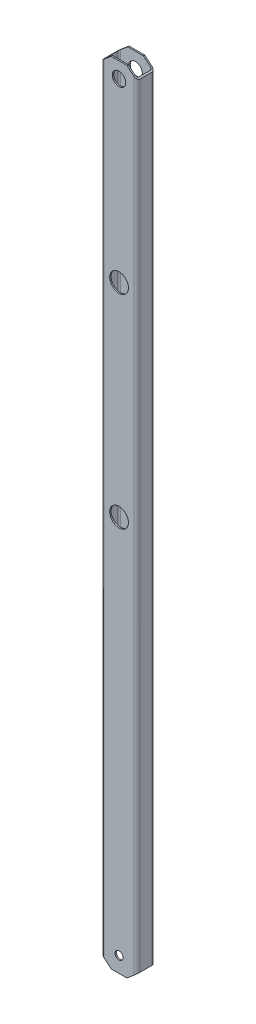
ISO-10303-21;
HEADER;
FILE_DESCRIPTION(('STEP AP214'),'2;1');
FILE_NAME('part.step','',(''),(''),'','','');
FILE_SCHEMA(('AUTOMOTIVE_DESIGN { 1 0 10303 214 1 1 1 1 }'));
ENDSEC;
DATA;
#1=APPLICATION_CONTEXT('core data for automotive mechanical design processes');
#2=APPLICATION_PROTOCOL_DEFINITION('international standard','automotive_design',2000,#1);
#3=PRODUCT_CONTEXT('',#1,'mechanical');
#4=PRODUCT('Part','Part','',(#3));
#5=PRODUCT_RELATED_PRODUCT_CATEGORY('part','',(#4));
#6=PRODUCT_DEFINITION_FORMATION('','',#4);
#7=PRODUCT_DEFINITION_CONTEXT('part definition',#1,'design');
#8=PRODUCT_DEFINITION('design','',#6,#7);
#9=PRODUCT_DEFINITION_SHAPE('','',#8);
#10=(LENGTH_UNIT() NAMED_UNIT(*) SI_UNIT(.MILLI.,.METRE.));
#11=(NAMED_UNIT(*) PLANE_ANGLE_UNIT() SI_UNIT($,.RADIAN.));
#12=(NAMED_UNIT(*) SI_UNIT($,.STERADIAN.) SOLID_ANGLE_UNIT());
#13=UNCERTAINTY_MEASURE_WITH_UNIT(LENGTH_MEASURE(1.E-05),#10,'distance_accuracy_value','');
#14=(GEOMETRIC_REPRESENTATION_CONTEXT(3) GLOBAL_UNCERTAINTY_ASSIGNED_CONTEXT((#13)) GLOBAL_UNIT_ASSIGNED_CONTEXT((#10,
#11,#12)) REPRESENTATION_CONTEXT('',''));
#15=CARTESIAN_POINT('',(0.,0.,0.));
#16=DIRECTION('',(0.,0.,1.));
#17=DIRECTION('',(1.,0.,0.));
#18=AXIS2_PLACEMENT_3D('',#15,#16,#17);
#19=CARTESIAN_POINT('',(33.6,-885.,-13.6000000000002));
#20=DIRECTION('',(0.,-1.,0.));
#21=DIRECTION('',(0.,0.,-1.));
#22=AXIS2_PLACEMENT_3D('',#19,#20,#21);
#23=PLANE('',#22);
#24=DIRECTION('',(0.,0.,-1.));
#25=VECTOR('',#24,1.);
#26=CARTESIAN_POINT('',(17.4999999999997,-885.,-13.6000000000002));
#27=LINE('',#26,#25);
#28=CARTESIAN_POINT('',(17.4999999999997,-885.,20.0000000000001));
#29=VERTEX_POINT('',#28);
#30=CARTESIAN_POINT('',(17.4999999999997,-885.,16.9999999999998));
#31=VERTEX_POINT('',#30);
#32=EDGE_CURVE('E12',#29,#31,#27,.T.);
#33=ORIENTED_EDGE('',*,*,#32,.F.);
#34=DIRECTION('',(-1.,0.,0.));
#35=VECTOR('',#34,1.);
#36=CARTESIAN_POINT('',(-33.6,-885.,19.9999999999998));
#37=LINE('',#36,#35);
#38=CARTESIAN_POINT('',(-17.5000000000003,-885.,20.0000000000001));
#39=VERTEX_POINT('',#38);
#40=EDGE_CURVE('E235',#29,#39,#37,.T.);
#41=ORIENTED_EDGE('',*,*,#40,.T.);
#42=DIRECTION('',(0.,0.,1.));
#43=VECTOR('',#42,1.);
#44=CARTESIAN_POINT('',(-17.5000000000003,-885.,-13.6000000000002));
#45=LINE('',#44,#43);
#46=CARTESIAN_POINT('',(-17.5000000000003,-885.,16.9999999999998));
#47=VERTEX_POINT('',#46);
#48=EDGE_CURVE('E71',#47,#39,#45,.T.);
#49=ORIENTED_EDGE('',*,*,#48,.F.);
#50=DIRECTION('',(-1.,0.,0.));
#51=VECTOR('',#50,1.);
#52=CARTESIAN_POINT('',(-33.6,-885.,16.9999999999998));
#53=LINE('',#52,#51);
#54=EDGE_CURVE('E244',#31,#47,#53,.T.);
#55=ORIENTED_EDGE('',*,*,#54,.F.);
#56=EDGE_LOOP('',(#33,#41,#49,#55));
#57=FACE_BOUND('',#56,.T.);
#58=ADVANCED_FACE('F63',(#57),#23,.T.);
#59=CARTESIAN_POINT('',(33.6,885.,-13.5999999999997));
#60=DIRECTION('',(0.,-1.,0.));
#61=DIRECTION('',(0.,0.,-1.));
#62=AXIS2_PLACEMENT_3D('',#59,#60,#61);
#63=PLANE('',#62);
#64=DIRECTION('',(-1.,0.,0.));
#65=VECTOR('',#64,1.);
#66=CARTESIAN_POINT('',(-33.6,885.,20.0000000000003));
#67=LINE('',#66,#65);
#68=CARTESIAN_POINT('',(17.5,885.,20.0000000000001));
#69=VERTEX_POINT('',#68);
#70=CARTESIAN_POINT('',(-17.5,885.,20.0000000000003));
#71=VERTEX_POINT('',#70);
#72=EDGE_CURVE('E260',#69,#71,#67,.T.);
#73=ORIENTED_EDGE('',*,*,#72,.F.);
#74=DIRECTION('',(0.,0.,-1.));
#75=VECTOR('',#74,1.);
#76=CARTESIAN_POINT('',(17.5,885.,-13.5999999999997));
#77=LINE('',#76,#75);
#78=CARTESIAN_POINT('',(17.5,885.,17.0000000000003));
#79=VERTEX_POINT('',#78);
#80=EDGE_CURVE('E228',#69,#79,#77,.T.);
#81=ORIENTED_EDGE('',*,*,#80,.T.);
#82=DIRECTION('',(-1.,0.,0.));
#83=VECTOR('',#82,1.);
#84=CARTESIAN_POINT('',(-33.6,885.,17.0000000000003));
#85=LINE('',#84,#83);
#86=CARTESIAN_POINT('',(-17.5,885.,17.0000000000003));
#87=VERTEX_POINT('',#86);
#88=EDGE_CURVE('E256',#79,#87,#85,.T.);
#89=ORIENTED_EDGE('',*,*,#88,.T.);
#90=DIRECTION('',(0.,0.,1.));
#91=VECTOR('',#90,1.);
#92=CARTESIAN_POINT('',(-17.5,885.,-13.5999999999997));
#93=LINE('',#92,#91);
#94=EDGE_CURVE('E288',#87,#71,#93,.T.);
#95=ORIENTED_EDGE('',*,*,#94,.T.);
#96=EDGE_LOOP('',(#73,#81,#89,#95));
#97=FACE_BOUND('',#96,.T.);
#98=ADVANCED_FACE('F317',(#97),#63,.F.);
#99=CARTESIAN_POINT('',(33.6,-885.,-13.6000000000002));
#100=DIRECTION('',(0.,1.,0.));
#101=DIRECTION('',(0.,0.,1.));
#102=AXIS2_PLACEMENT_3D('',#99,#100,#101);
#103=CYLINDRICAL_SURFACE('',#102,6.40000000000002);
#104=DIRECTION('',(0.,1.,0.));
#105=VECTOR('',#104,1.);
#106=CARTESIAN_POINT('',(33.6,-885.,-20.0000000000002));
#107=LINE('',#106,#105);
#108=CARTESIAN_POINT('',(33.6,-871.490495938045,-20.0000000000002));
#109=VERTEX_POINT('',#108);
#110=CARTESIAN_POINT('',(33.5999999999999,871.490495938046,-19.9999999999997));
#111=VERTEX_POINT('',#110);
#112=EDGE_CURVE('E266',#109,#111,#107,.T.);
#113=ORIENTED_EDGE('',*,*,#112,.T.);
#114=CARTESIAN_POINT('',(33.6,871.490495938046,-13.5999999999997));
#115=DIRECTION('',(-0.642787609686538,-0.766044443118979,0.));
#116=DIRECTION('',(-0.766044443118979,0.642787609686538,0.));
#117=AXIS2_PLACEMENT_3D('',#114,#115,#116);
#118=ELLIPSE('',#117,8.35460665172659,6.40000000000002);
#119=CARTESIAN_POINT('',(40.,866.120258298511,-13.6000000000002));
#120=VERTEX_POINT('',#119);
#121=EDGE_CURVE('E363',#111,#120,#118,.T.);
#122=ORIENTED_EDGE('',*,*,#121,.T.);
#123=DIRECTION('',(0.,1.,0.));
#124=VECTOR('',#123,1.);
#125=CARTESIAN_POINT('',(40.,-885.,-13.6000000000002));
#126=LINE('',#125,#124);
#127=CARTESIAN_POINT('',(39.9999999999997,-866.120258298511,-13.6000000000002));
#128=VERTEX_POINT('',#127);
#129=EDGE_CURVE('E285',#128,#120,#126,.T.);
#130=ORIENTED_EDGE('',*,*,#129,.F.);
#131=CARTESIAN_POINT('',(33.6,-871.490495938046,-13.6000000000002));
#132=DIRECTION('',(-0.642787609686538,0.766044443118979,0.));
#133=DIRECTION('',(0.766044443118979,0.642787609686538,0.));
#134=AXIS2_PLACEMENT_3D('',#131,#132,#133);
#135=ELLIPSE('',#134,8.35460665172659,6.40000000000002);
#136=EDGE_CURVE('E392',#128,#109,#135,.T.);
#137=ORIENTED_EDGE('',*,*,#136,.T.);
#138=EDGE_LOOP('',(#113,#122,#130,#137));
#139=FACE_BOUND('',#138,.T.);
#140=ADVANCED_FACE('F566',(#139),#103,.T.);
#141=CARTESIAN_POINT('',(40.,-885.,-13.6000000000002));
#142=DIRECTION('',(-1.,0.,0.));
#143=DIRECTION('',(0.,0.,1.));
#144=AXIS2_PLACEMENT_3D('',#141,#142,#143);
#145=PLANE('',#144);
#146=ORIENTED_EDGE('',*,*,#129,.T.);
#147=DIRECTION('',(0.,0.,1.));
#148=VECTOR('',#147,1.);
#149=CARTESIAN_POINT('',(40.,866.120258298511,-79.3969696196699));
#150=LINE('',#149,#148);
#151=CARTESIAN_POINT('',(40.,866.120258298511,13.6000000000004));
#152=VERTEX_POINT('',#151);
#153=EDGE_CURVE('E471',#120,#152,#150,.T.);
#154=ORIENTED_EDGE('',*,*,#153,.T.);
#155=DIRECTION('',(0.,1.,0.));
#156=VECTOR('',#155,1.);
#157=CARTESIAN_POINT('',(40.,-885.,13.5999999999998));
#158=LINE('',#157,#156);
#159=CARTESIAN_POINT('',(40.,-866.120258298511,13.5999999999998));
#160=VERTEX_POINT('',#159);
#161=EDGE_CURVE('E282',#160,#152,#158,.T.);
#162=ORIENTED_EDGE('',*,*,#161,.F.);
#163=DIRECTION('',(0.,0.,1.));
#164=VECTOR('',#163,1.);
#165=CARTESIAN_POINT('',(39.9999999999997,-866.120258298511,-79.3969696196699));
#166=LINE('',#165,#164);
#167=EDGE_CURVE('E428',#128,#160,#166,.T.);
#168=ORIENTED_EDGE('',*,*,#167,.F.);
#169=EDGE_LOOP('',(#146,#154,#162,#168));
#170=FACE_BOUND('',#169,.T.);
#171=ADVANCED_FACE('F587',(#170),#145,.F.);
#172=CARTESIAN_POINT('',(33.6,-885.,13.5999999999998));
#173=DIRECTION('',(0.,1.,0.));
#174=DIRECTION('',(0.,0.,1.));
#175=AXIS2_PLACEMENT_3D('',#172,#173,#174);
#176=CYLINDRICAL_SURFACE('',#175,6.40000000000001);
#177=ORIENTED_EDGE('',*,*,#161,.T.);
#178=CARTESIAN_POINT('',(33.6,871.490495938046,13.6000000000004));
#179=DIRECTION('',(-0.642787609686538,-0.766044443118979,0.));
#180=DIRECTION('',(-0.766044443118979,0.642787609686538,0.));
#181=AXIS2_PLACEMENT_3D('',#178,#179,#180);
#182=ELLIPSE('',#181,8.35460665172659,6.40000000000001);
#183=CARTESIAN_POINT('',(33.5999999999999,871.490495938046,20.0000000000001));
#184=VERTEX_POINT('',#183);
#185=EDGE_CURVE('E360',#152,#184,#182,.T.);
#186=ORIENTED_EDGE('',*,*,#185,.T.);
#187=DIRECTION('',(0.,1.,0.));
#188=VECTOR('',#187,1.);
#189=CARTESIAN_POINT('',(33.6,-885.,19.9999999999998));
#190=LINE('',#189,#188);
#191=CARTESIAN_POINT('',(33.6,-871.490495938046,20.0000000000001));
#192=VERTEX_POINT('',#191);
#193=EDGE_CURVE('E280',#192,#184,#190,.T.);
#194=ORIENTED_EDGE('',*,*,#193,.F.);
#195=CARTESIAN_POINT('',(33.6,-871.490495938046,13.5999999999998));
#196=DIRECTION('',(-0.642787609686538,0.766044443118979,0.));
#197=DIRECTION('',(0.766044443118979,0.642787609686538,0.));
#198=AXIS2_PLACEMENT_3D('',#195,#196,#197);
#199=ELLIPSE('',#198,8.35460665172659,6.40000000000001);
#200=EDGE_CURVE('E389',#192,#160,#199,.T.);
#201=ORIENTED_EDGE('',*,*,#200,.T.);
#202=EDGE_LOOP('',(#177,#186,#194,#201));
#203=FACE_BOUND('',#202,.T.);
#204=ADVANCED_FACE('F534',(#203),#176,.T.);
#205=CARTESIAN_POINT('',(-33.6,-885.,19.9999999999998));
#206=DIRECTION('',(0.,0.,-1.));
#207=DIRECTION('',(-1.,0.,0.));
#208=AXIS2_PLACEMENT_3D('',#205,#206,#207);
#209=PLANE('',#208);
#210=CARTESIAN_POINT('',(0.,455.,20.0000000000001));
#211=DIRECTION('',(0.,0.,1.));
#212=DIRECTION('',(1.,0.,0.));
#213=AXIS2_PLACEMENT_3D('',#210,#211,#212);
#214=CIRCLE('',#213,21.);
#215=CARTESIAN_POINT('',(21.,455.,20.0000000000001));
#216=VERTEX_POINT('',#215);
#217=EDGE_CURVE('E526',#216,#216,#214,.T.);
#218=ORIENTED_EDGE('',*,*,#217,.F.);
#219=EDGE_LOOP('',(#218));
#220=FACE_BOUND('',#219,.T.);
#221=CARTESIAN_POINT('',(0.,850.,20.0000000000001));
#222=DIRECTION('',(0.,0.,1.));
#223=DIRECTION('',(1.,0.,0.));
#224=AXIS2_PLACEMENT_3D('',#221,#222,#223);
#225=CIRCLE('',#224,15.);
#226=CARTESIAN_POINT('',(15.,850.,20.0000000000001));
#227=VERTEX_POINT('',#226);
#228=EDGE_CURVE('E461',#227,#227,#225,.T.);
#229=ORIENTED_EDGE('',*,*,#228,.F.);
#230=EDGE_LOOP('',(#229));
#231=FACE_BOUND('',#230,.T.);
#232=CARTESIAN_POINT('',(0.,-850.,20.0000000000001));
#233=DIRECTION('',(0.,0.,1.));
#234=DIRECTION('',(1.,0.,0.));
#235=AXIS2_PLACEMENT_3D('',#232,#233,#234);
#236=CIRCLE('',#235,9.);
#237=CARTESIAN_POINT('',(9.,-850.,20.0000000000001));
#238=VERTEX_POINT('',#237);
#239=EDGE_CURVE('E430',#238,#238,#236,.T.);
#240=ORIENTED_EDGE('',*,*,#239,.F.);
#241=EDGE_LOOP('',(#240));
#242=FACE_BOUND('',#241,.T.);
#243=CARTESIAN_POINT('',(0.,0.,20.0000000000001));
#244=DIRECTION('',(0.,0.,1.));
#245=DIRECTION('',(1.,0.,0.));
#246=AXIS2_PLACEMENT_3D('',#243,#244,#245);
#247=CIRCLE('',#246,21.);
#248=CARTESIAN_POINT('',(21.,0.,20.0000000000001));
#249=VERTEX_POINT('',#248);
#250=EDGE_CURVE('E455',#249,#249,#247,.T.);
#251=ORIENTED_EDGE('',*,*,#250,.F.);
#252=EDGE_LOOP('',(#251));
#253=FACE_BOUND('',#252,.T.);
#254=ORIENTED_EDGE('',*,*,#193,.T.);
#255=DIRECTION('',(0.766044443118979,-0.642787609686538,0.));
#256=VECTOR('',#255,1.);
#257=CARTESIAN_POINT('',(40.,866.120258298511,20.0000000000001));
#258=LINE('',#257,#256);
#259=EDGE_CURVE('E469',#69,#184,#258,.T.);
#260=ORIENTED_EDGE('',*,*,#259,.F.);
#261=ORIENTED_EDGE('',*,*,#72,.T.);
#262=DIRECTION('',(0.766044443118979,0.642787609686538,0.));
#263=VECTOR('',#262,1.);
#264=CARTESIAN_POINT('',(-40.,866.120258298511,20.0000000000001));
#265=LINE('',#264,#263);
#266=CARTESIAN_POINT('',(-33.6,871.490495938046,20.0000000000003));
#267=VERTEX_POINT('',#266);
#268=EDGE_CURVE('E437',#267,#71,#265,.T.);
#269=ORIENTED_EDGE('',*,*,#268,.F.);
#270=DIRECTION('',(0.,1.,0.));
#271=VECTOR('',#270,1.);
#272=CARTESIAN_POINT('',(-33.6,-885.,19.9999999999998));
#273=LINE('',#272,#271);
#274=CARTESIAN_POINT('',(-33.6,-871.490495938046,20.));
#275=VERTEX_POINT('',#274);
#276=EDGE_CURVE('E238',#275,#267,#273,.T.);
#277=ORIENTED_EDGE('',*,*,#276,.F.);
#278=DIRECTION('',(-0.766044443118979,0.642787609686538,0.));
#279=VECTOR('',#278,1.);
#280=CARTESIAN_POINT('',(-40.0000000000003,-866.120258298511,20.0000000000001));
#281=LINE('',#280,#279);
#282=EDGE_CURVE('E222',#39,#275,#281,.T.);
#283=ORIENTED_EDGE('',*,*,#282,.F.);
#284=ORIENTED_EDGE('',*,*,#40,.F.);
#285=DIRECTION('',(-0.766044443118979,-0.642787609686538,0.));
#286=VECTOR('',#285,1.);
#287=CARTESIAN_POINT('',(39.9999999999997,-866.120258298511,20.0000000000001));
#288=LINE('',#287,#286);
#289=EDGE_CURVE('E432',#192,#29,#288,.T.);
#290=ORIENTED_EDGE('',*,*,#289,.F.);
#291=EDGE_LOOP('',(#254,#260,#261,#269,#277,#283,#284,#290));
#292=FACE_BOUND('',#291,.T.);
#293=ADVANCED_FACE('F233',(#220,#231,#242,#253,#292),#209,.F.);
#294=CARTESIAN_POINT('',(-33.6,-885.,13.5999999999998));
#295=DIRECTION('',(0.,1.,0.));
#296=DIRECTION('',(0.,0.,1.));
#297=AXIS2_PLACEMENT_3D('',#294,#295,#296);
#298=CYLINDRICAL_SURFACE('',#297,6.40000000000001);
#299=DIRECTION('',(0.,1.,0.));
#300=VECTOR('',#299,1.);
#301=CARTESIAN_POINT('',(-40.,-885.,13.5999999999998));
#302=LINE('',#301,#300);
#303=CARTESIAN_POINT('',(-40.0000000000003,-866.120258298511,13.6000000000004));
#304=VERTEX_POINT('',#303);
#305=CARTESIAN_POINT('',(-40.,866.120258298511,13.6000000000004));
#306=VERTEX_POINT('',#305);
#307=EDGE_CURVE('E276',#304,#306,#302,.T.);
#308=ORIENTED_EDGE('',*,*,#307,.F.);
#309=CARTESIAN_POINT('',(-33.6,-871.490495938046,13.5999999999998));
#310=DIRECTION('',(0.642787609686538,0.766044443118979,0.));
#311=DIRECTION('',(-0.766044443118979,0.642787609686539,0.));
#312=AXIS2_PLACEMENT_3D('',#309,#310,#311);
#313=ELLIPSE('',#312,8.35460665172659,6.40000000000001);
#314=EDGE_CURVE('E378',#304,#275,#313,.T.);
#315=ORIENTED_EDGE('',*,*,#314,.T.);
#316=ORIENTED_EDGE('',*,*,#276,.T.);
#317=CARTESIAN_POINT('',(-33.6,871.490495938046,13.6000000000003));
#318=DIRECTION('',(0.642787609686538,-0.766044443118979,0.));
#319=DIRECTION('',(0.766044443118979,0.642787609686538,0.));
#320=AXIS2_PLACEMENT_3D('',#317,#318,#319);
#321=ELLIPSE('',#320,8.35460665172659,6.40000000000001);
#322=EDGE_CURVE('E348',#267,#306,#321,.T.);
#323=ORIENTED_EDGE('',*,*,#322,.T.);
#324=EDGE_LOOP('',(#308,#315,#316,#323));
#325=FACE_BOUND('',#324,.T.);
#326=ADVANCED_FACE('F448',(#325),#298,.T.);
#327=CARTESIAN_POINT('',(-40.,-885.,13.5999999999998));
#328=DIRECTION('',(1.,0.,0.));
#329=DIRECTION('',(0.,0.,-1.));
#330=AXIS2_PLACEMENT_3D('',#327,#328,#329);
#331=PLANE('',#330);
#332=DIRECTION('',(0.,1.,0.));
#333=VECTOR('',#332,1.);
#334=CARTESIAN_POINT('',(-40.,-885.,-13.6000000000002));
#335=LINE('',#334,#333);
#336=CARTESIAN_POINT('',(-40.0000000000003,-866.120258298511,-13.6000000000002));
#337=VERTEX_POINT('',#336);
#338=CARTESIAN_POINT('',(-40.,866.120258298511,-13.5999999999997));
#339=VERTEX_POINT('',#338);
#340=EDGE_CURVE('E273',#337,#339,#335,.T.);
#341=ORIENTED_EDGE('',*,*,#340,.F.);
#342=DIRECTION('',(0.,0.,1.));
#343=VECTOR('',#342,1.);
#344=CARTESIAN_POINT('',(-40.0000000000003,-866.120258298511,-79.3969696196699));
#345=LINE('',#344,#343);
#346=EDGE_CURVE('E239',#337,#304,#345,.T.);
#347=ORIENTED_EDGE('',*,*,#346,.T.);
#348=ORIENTED_EDGE('',*,*,#307,.T.);
#349=DIRECTION('',(0.,0.,1.));
#350=VECTOR('',#349,1.);
#351=CARTESIAN_POINT('',(-40.,866.120258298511,-79.3969696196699));
#352=LINE('',#351,#350);
#353=EDGE_CURVE('E439',#339,#306,#352,.T.);
#354=ORIENTED_EDGE('',*,*,#353,.F.);
#355=EDGE_LOOP('',(#341,#347,#348,#354));
#356=FACE_BOUND('',#355,.T.);
#357=ADVANCED_FACE('F450',(#356),#331,.F.);
#358=CARTESIAN_POINT('',(-33.6,-885.,-13.6000000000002));
#359=DIRECTION('',(0.,1.,0.));
#360=DIRECTION('',(0.,0.,1.));
#361=AXIS2_PLACEMENT_3D('',#358,#359,#360);
#362=CYLINDRICAL_SURFACE('',#361,6.40000000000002);
#363=DIRECTION('',(0.,1.,0.));
#364=VECTOR('',#363,1.);
#365=CARTESIAN_POINT('',(-33.6,-885.,-20.0000000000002));
#366=LINE('',#365,#364);
#367=CARTESIAN_POINT('',(-33.6,-871.490495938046,-20.0000000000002));
#368=VERTEX_POINT('',#367);
#369=CARTESIAN_POINT('',(-33.5999999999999,871.490495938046,-19.9999999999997));
#370=VERTEX_POINT('',#369);
#371=EDGE_CURVE('E269',#368,#370,#366,.T.);
#372=ORIENTED_EDGE('',*,*,#371,.F.);
#373=CARTESIAN_POINT('',(-33.6,-871.490495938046,-13.6000000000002));
#374=DIRECTION('',(0.642787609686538,0.766044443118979,0.));
#375=DIRECTION('',(-0.766044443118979,0.642787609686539,0.));
#376=AXIS2_PLACEMENT_3D('',#373,#374,#375);
#377=ELLIPSE('',#376,8.3546066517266,6.40000000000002);
#378=EDGE_CURVE('E375',#368,#337,#377,.T.);
#379=ORIENTED_EDGE('',*,*,#378,.T.);
#380=ORIENTED_EDGE('',*,*,#340,.T.);
#381=CARTESIAN_POINT('',(-33.6,871.490495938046,-13.5999999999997));
#382=DIRECTION('',(0.642787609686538,-0.766044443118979,0.));
#383=DIRECTION('',(0.766044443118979,0.642787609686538,0.));
#384=AXIS2_PLACEMENT_3D('',#381,#382,#383);
#385=ELLIPSE('',#384,8.35460665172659,6.40000000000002);
#386=EDGE_CURVE('E345',#339,#370,#385,.T.);
#387=ORIENTED_EDGE('',*,*,#386,.T.);
#388=EDGE_LOOP('',(#372,#379,#380,#387));
#389=FACE_BOUND('',#388,.T.);
#390=ADVANCED_FACE('F577',(#389),#362,.T.);
#391=CARTESIAN_POINT('',(33.6,-885.,13.5999999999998));
#392=DIRECTION('',(0.,1.,0.));
#393=DIRECTION('',(0.,0.,1.));
#394=AXIS2_PLACEMENT_3D('',#391,#392,#393);
#395=CYLINDRICAL_SURFACE('',#394,3.4);
#396=CARTESIAN_POINT('',(33.6,871.490495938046,13.6000000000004));
#397=DIRECTION('',(-0.642787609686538,-0.766044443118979,0.));
#398=DIRECTION('',(-0.766044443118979,0.642787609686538,0.));
#399=AXIS2_PLACEMENT_3D('',#396,#397,#398);
#400=ELLIPSE('',#399,4.43838478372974,3.4);
#401=CARTESIAN_POINT('',(37.,868.637557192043,13.6000000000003));
#402=VERTEX_POINT('',#401);
#403=CARTESIAN_POINT('',(33.6,871.490495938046,17.0000000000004));
#404=VERTEX_POINT('',#403);
#405=EDGE_CURVE('E352',#402,#404,#400,.T.);
#406=ORIENTED_EDGE('',*,*,#405,.F.);
#407=DIRECTION('',(0.,1.,0.));
#408=VECTOR('',#407,1.);
#409=CARTESIAN_POINT('',(37.,-885.,13.5999999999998));
#410=LINE('',#409,#408);
#411=CARTESIAN_POINT('',(37.,-868.637557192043,13.5999999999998));
#412=VERTEX_POINT('',#411);
#413=EDGE_CURVE('E270',#412,#402,#410,.T.);
#414=ORIENTED_EDGE('',*,*,#413,.F.);
#415=CARTESIAN_POINT('',(33.6,-871.490495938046,13.5999999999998));
#416=DIRECTION('',(-0.642787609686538,0.766044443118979,0.));
#417=DIRECTION('',(0.766044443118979,0.642787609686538,0.));
#418=AXIS2_PLACEMENT_3D('',#415,#416,#417);
#419=ELLIPSE('',#418,4.43838478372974,3.4);
#420=CARTESIAN_POINT('',(33.6,-871.490495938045,16.9999999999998));
#421=VERTEX_POINT('',#420);
#422=EDGE_CURVE('E382',#421,#412,#419,.T.);
#423=ORIENTED_EDGE('',*,*,#422,.F.);
#424=DIRECTION('',(0.,1.,0.));
#425=VECTOR('',#424,1.);
#426=CARTESIAN_POINT('',(33.6,-885.,16.9999999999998));
#427=LINE('',#426,#425);
#428=EDGE_CURVE('E247',#421,#404,#427,.T.);
#429=ORIENTED_EDGE('',*,*,#428,.T.);
#430=EDGE_LOOP('',(#406,#414,#423,#429));
#431=FACE_BOUND('',#430,.T.);
#432=ADVANCED_FACE('F65',(#431),#395,.F.);
#433=CARTESIAN_POINT('',(37.,-885.,-13.6000000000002));
#434=DIRECTION('',(-1.,0.,0.));
#435=DIRECTION('',(0.,0.,1.));
#436=AXIS2_PLACEMENT_3D('',#433,#434,#435);
#437=PLANE('',#436);
#438=DIRECTION('',(0.,0.,1.));
#439=VECTOR('',#438,1.);
#440=CARTESIAN_POINT('',(37.,868.637557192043,-13.6000000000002));
#441=LINE('',#440,#439);
#442=CARTESIAN_POINT('',(37.,868.637557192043,-13.6000000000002));
#443=VERTEX_POINT('',#442);
#444=EDGE_CURVE('E354',#443,#402,#441,.T.);
#445=ORIENTED_EDGE('',*,*,#444,.F.);
#446=DIRECTION('',(0.,1.,0.));
#447=VECTOR('',#446,1.);
#448=CARTESIAN_POINT('',(37.,-885.,-13.6000000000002));
#449=LINE('',#448,#447);
#450=CARTESIAN_POINT('',(37.,-868.637557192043,-13.6000000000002));
#451=VERTEX_POINT('',#450);
#452=EDGE_CURVE('E306',#451,#443,#449,.T.);
#453=ORIENTED_EDGE('',*,*,#452,.F.);
#454=DIRECTION('',(0.,0.,-1.));
#455=VECTOR('',#454,1.);
#456=CARTESIAN_POINT('',(37.,-868.637557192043,-13.6000000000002));
#457=LINE('',#456,#455);
#458=EDGE_CURVE('E384',#412,#451,#457,.T.);
#459=ORIENTED_EDGE('',*,*,#458,.F.);
#460=ORIENTED_EDGE('',*,*,#413,.T.);
#461=EDGE_LOOP('',(#445,#453,#459,#460));
#462=FACE_BOUND('',#461,.T.);
#463=ADVANCED_FACE('F507',(#462),#437,.T.);
#464=CARTESIAN_POINT('',(33.6,-885.,-13.6000000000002));
#465=DIRECTION('',(0.,1.,0.));
#466=DIRECTION('',(0.,0.,1.));
#467=AXIS2_PLACEMENT_3D('',#464,#465,#466);
#468=CYLINDRICAL_SURFACE('',#467,3.4);
#469=CARTESIAN_POINT('',(33.6,871.490495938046,-13.5999999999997));
#470=DIRECTION('',(-0.642787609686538,-0.766044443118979,0.));
#471=DIRECTION('',(-0.766044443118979,0.642787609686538,0.));
#472=AXIS2_PLACEMENT_3D('',#469,#470,#471);
#473=ELLIPSE('',#472,4.43838478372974,3.4);
#474=CARTESIAN_POINT('',(33.6,871.490495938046,-16.9999999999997));
#475=VERTEX_POINT('',#474);
#476=EDGE_CURVE('E356',#475,#443,#473,.T.);
#477=ORIENTED_EDGE('',*,*,#476,.F.);
#478=DIRECTION('',(0.,1.,0.));
#479=VECTOR('',#478,1.);
#480=CARTESIAN_POINT('',(33.6,-885.,-17.0000000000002));
#481=LINE('',#480,#479);
#482=CARTESIAN_POINT('',(33.6,-871.490495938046,-17.0000000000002));
#483=VERTEX_POINT('',#482);
#484=EDGE_CURVE('E303',#483,#475,#481,.T.);
#485=ORIENTED_EDGE('',*,*,#484,.F.);
#486=CARTESIAN_POINT('',(33.6,-871.490495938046,-13.6000000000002));
#487=DIRECTION('',(-0.642787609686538,0.766044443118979,0.));
#488=DIRECTION('',(0.766044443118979,0.642787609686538,0.));
#489=AXIS2_PLACEMENT_3D('',#486,#487,#488);
#490=ELLIPSE('',#489,4.43838478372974,3.4);
#491=EDGE_CURVE('E386',#451,#483,#490,.T.);
#492=ORIENTED_EDGE('',*,*,#491,.F.);
#493=ORIENTED_EDGE('',*,*,#452,.T.);
#494=EDGE_LOOP('',(#477,#485,#492,#493));
#495=FACE_BOUND('',#494,.T.);
#496=ADVANCED_FACE('F502',(#495),#468,.F.);
#497=CARTESIAN_POINT('',(33.6,-885.,-17.0000000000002));
#498=DIRECTION('',(0.,0.,1.));
#499=DIRECTION('',(0.,-1.,0.));
#500=AXIS2_PLACEMENT_3D('',#497,#498,#499);
#501=PLANE('',#500);
#502=CARTESIAN_POINT('',(0.,455.,-16.9999999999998));
#503=DIRECTION('',(0.,0.,1.));
#504=DIRECTION('',(0.,-1.,0.));
#505=AXIS2_PLACEMENT_3D('',#502,#503,#504);
#506=CIRCLE('',#505,21.);
#507=CARTESIAN_POINT('',(0.,434.,-16.9999999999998));
#508=VERTEX_POINT('',#507);
#509=EDGE_CURVE('E458',#508,#508,#506,.T.);
#510=ORIENTED_EDGE('',*,*,#509,.F.);
#511=EDGE_LOOP('',(#510));
#512=FACE_BOUND('',#511,.T.);
#513=CARTESIAN_POINT('',(0.,850.,-16.9999999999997));
#514=DIRECTION('',(0.,0.,1.));
#515=DIRECTION('',(0.,-1.,0.));
#516=AXIS2_PLACEMENT_3D('',#513,#514,#515);
#517=CIRCLE('',#516,15.);
#518=CARTESIAN_POINT('',(0.,835.,-16.9999999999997));
#519=VERTEX_POINT('',#518);
#520=EDGE_CURVE('E257',#519,#519,#517,.T.);
#521=ORIENTED_EDGE('',*,*,#520,.F.);
#522=EDGE_LOOP('',(#521));
#523=FACE_BOUND('',#522,.T.);
#524=DIRECTION('',(0.766044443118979,-0.642787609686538,0.));
#525=VECTOR('',#524,1.);
#526=CARTESIAN_POINT('',(898.502729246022,145.750934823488,-16.9999999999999));
#527=LINE('',#526,#525);
#528=CARTESIAN_POINT('',(17.5,885.,-16.9999999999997));
#529=VERTEX_POINT('',#528);
#530=EDGE_CURVE('E358',#529,#475,#527,.T.);
#531=ORIENTED_EDGE('',*,*,#530,.F.);
#532=DIRECTION('',(1.,0.,0.));
#533=VECTOR('',#532,1.);
#534=CARTESIAN_POINT('',(33.6,885.,-16.9999999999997));
#535=LINE('',#534,#533);
#536=CARTESIAN_POINT('',(-17.5,885.,-16.9999999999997));
#537=VERTEX_POINT('',#536);
#538=EDGE_CURVE('E253',#537,#529,#535,.T.);
#539=ORIENTED_EDGE('',*,*,#538,.F.);
#540=DIRECTION('',(0.766044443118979,0.642787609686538,0.));
#541=VECTOR('',#540,1.);
#542=CARTESIAN_POINT('',(-859.068150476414,178.840475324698,-16.9999999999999));
#543=LINE('',#542,#541);
#544=CARTESIAN_POINT('',(-33.6,871.490495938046,-16.9999999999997));
#545=VERTEX_POINT('',#544);
#546=EDGE_CURVE('E343',#545,#537,#543,.T.);
#547=ORIENTED_EDGE('',*,*,#546,.F.);
#548=DIRECTION('',(0.,1.,0.));
#549=VECTOR('',#548,1.);
#550=CARTESIAN_POINT('',(-33.6,-885.,-17.0000000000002));
#551=LINE('',#550,#549);
#552=CARTESIAN_POINT('',(-33.6,-871.490495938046,-17.0000000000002));
#553=VERTEX_POINT('',#552);
#554=EDGE_CURVE('E300',#553,#545,#551,.T.);
#555=ORIENTED_EDGE('',*,*,#554,.F.);
#556=DIRECTION('',(-0.766044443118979,0.642787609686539,0.));
#557=VECTOR('',#556,1.);
#558=CARTESIAN_POINT('',(12.48671093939,-910.161838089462,-17.0000000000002));
#559=LINE('',#558,#557);
#560=CARTESIAN_POINT('',(-17.5000000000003,-885.,-17.0000000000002));
#561=VERTEX_POINT('',#560);
#562=EDGE_CURVE('E373',#561,#553,#559,.T.);
#563=ORIENTED_EDGE('',*,*,#562,.F.);
#564=DIRECTION('',(1.,0.,0.));
#565=VECTOR('',#564,1.);
#566=CARTESIAN_POINT('',(33.6,-885.,-17.0000000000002));
#567=LINE('',#566,#565);
#568=CARTESIAN_POINT('',(17.4999999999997,-885.,-17.0000000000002));
#569=VERTEX_POINT('',#568);
#570=EDGE_CURVE('E249',#561,#569,#567,.T.);
#571=ORIENTED_EDGE('',*,*,#570,.T.);
#572=DIRECTION('',(-0.766044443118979,-0.642787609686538,0.));
#573=VECTOR('',#572,1.);
#574=CARTESIAN_POINT('',(26.9478678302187,-877.072297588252,-17.0000000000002));
#575=LINE('',#574,#573);
#576=EDGE_CURVE('E86',#483,#569,#575,.T.);
#577=ORIENTED_EDGE('',*,*,#576,.F.);
#578=ORIENTED_EDGE('',*,*,#484,.T.);
#579=EDGE_LOOP('',(#531,#539,#547,#555,#563,#571,#577,#578));
#580=FACE_BOUND('',#579,.T.);
#581=CARTESIAN_POINT('',(0.,-850.,-17.0000000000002));
#582=DIRECTION('',(0.,0.,1.));
#583=DIRECTION('',(0.,-1.,0.));
#584=AXIS2_PLACEMENT_3D('',#581,#582,#583);
#585=CIRCLE('',#584,9.);
#586=CARTESIAN_POINT('',(0.,-859.,-17.0000000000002));
#587=VERTEX_POINT('',#586);
#588=EDGE_CURVE('E404',#587,#587,#585,.T.);
#589=ORIENTED_EDGE('',*,*,#588,.F.);
#590=EDGE_LOOP('',(#589));
#591=FACE_BOUND('',#590,.T.);
#592=CARTESIAN_POINT('',(0.,0.,-16.9999999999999));
#593=DIRECTION('',(0.,0.,1.));
#594=DIRECTION('',(0.,-1.,0.));
#595=AXIS2_PLACEMENT_3D('',#592,#593,#594);
#596=CIRCLE('',#595,21.);
#597=CARTESIAN_POINT('',(0.,-21.,-17.));
#598=VERTEX_POINT('',#597);
#599=EDGE_CURVE('E398',#598,#598,#596,.T.);
#600=ORIENTED_EDGE('',*,*,#599,.F.);
#601=EDGE_LOOP('',(#600));
#602=FACE_BOUND('',#601,.T.);
#603=ADVANCED_FACE('F416',(#512,#523,#580,#591,#602),#501,.T.);
#604=CARTESIAN_POINT('',(-33.6,-885.,-13.6000000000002));
#605=DIRECTION('',(0.,1.,0.));
#606=DIRECTION('',(0.,0.,1.));
#607=AXIS2_PLACEMENT_3D('',#604,#605,#606);
#608=CYLINDRICAL_SURFACE('',#607,3.4);
#609=CARTESIAN_POINT('',(-33.6,-871.490495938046,-13.6000000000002));
#610=DIRECTION('',(0.642787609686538,0.766044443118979,0.));
#611=DIRECTION('',(-0.766044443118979,0.642787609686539,0.));
#612=AXIS2_PLACEMENT_3D('',#609,#610,#611);
#613=ELLIPSE('',#612,4.43838478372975,3.4);
#614=CARTESIAN_POINT('',(-37.,-868.637557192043,-13.6000000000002));
#615=VERTEX_POINT('',#614);
#616=EDGE_CURVE('E371',#553,#615,#613,.T.);
#617=ORIENTED_EDGE('',*,*,#616,.F.);
#618=ORIENTED_EDGE('',*,*,#554,.T.);
#619=CARTESIAN_POINT('',(-33.6,871.490495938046,-13.5999999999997));
#620=DIRECTION('',(0.642787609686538,-0.766044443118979,0.));
#621=DIRECTION('',(0.766044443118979,0.642787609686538,0.));
#622=AXIS2_PLACEMENT_3D('',#619,#620,#621);
#623=ELLIPSE('',#622,4.43838478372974,3.4);
#624=CARTESIAN_POINT('',(-37.,868.637557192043,-13.6000000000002));
#625=VERTEX_POINT('',#624);
#626=EDGE_CURVE('E341',#625,#545,#623,.T.);
#627=ORIENTED_EDGE('',*,*,#626,.F.);
#628=DIRECTION('',(0.,1.,0.));
#629=VECTOR('',#628,1.);
#630=CARTESIAN_POINT('',(-37.,-885.,-13.6000000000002));
#631=LINE('',#630,#629);
#632=EDGE_CURVE('E297',#615,#625,#631,.T.);
#633=ORIENTED_EDGE('',*,*,#632,.F.);
#634=EDGE_LOOP('',(#617,#618,#627,#633));
#635=FACE_BOUND('',#634,.T.);
#636=ADVANCED_FACE('F605',(#635),#608,.F.);
#637=CARTESIAN_POINT('',(-37.,-885.,13.5999999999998));
#638=DIRECTION('',(1.,0.,0.));
#639=DIRECTION('',(0.,0.,-1.));
#640=AXIS2_PLACEMENT_3D('',#637,#638,#639);
#641=PLANE('',#640);
#642=DIRECTION('',(0.,0.,1.));
#643=VECTOR('',#642,1.);
#644=CARTESIAN_POINT('',(-37.,-868.637557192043,13.5999999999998));
#645=LINE('',#644,#643);
#646=CARTESIAN_POINT('',(-37.,-868.637557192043,13.5999999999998));
#647=VERTEX_POINT('',#646);
#648=EDGE_CURVE('E369',#615,#647,#645,.T.);
#649=ORIENTED_EDGE('',*,*,#648,.F.);
#650=ORIENTED_EDGE('',*,*,#632,.T.);
#651=DIRECTION('',(0.,0.,-1.));
#652=VECTOR('',#651,1.);
#653=CARTESIAN_POINT('',(-37.,868.637557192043,13.5999999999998));
#654=LINE('',#653,#652);
#655=CARTESIAN_POINT('',(-37.,868.637557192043,13.6000000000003));
#656=VERTEX_POINT('',#655);
#657=EDGE_CURVE('E334',#656,#625,#654,.T.);
#658=ORIENTED_EDGE('',*,*,#657,.F.);
#659=DIRECTION('',(0.,1.,0.));
#660=VECTOR('',#659,1.);
#661=CARTESIAN_POINT('',(-37.,-885.,13.5999999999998));
#662=LINE('',#661,#660);
#663=EDGE_CURVE('E294',#647,#656,#662,.T.);
#664=ORIENTED_EDGE('',*,*,#663,.F.);
#665=EDGE_LOOP('',(#649,#650,#658,#664));
#666=FACE_BOUND('',#665,.T.);
#667=ADVANCED_FACE('F601',(#666),#641,.T.);
#668=CARTESIAN_POINT('',(-33.6,-885.,13.5999999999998));
#669=DIRECTION('',(0.,1.,0.));
#670=DIRECTION('',(0.,0.,1.));
#671=AXIS2_PLACEMENT_3D('',#668,#669,#670);
#672=CYLINDRICAL_SURFACE('',#671,3.4);
#673=CARTESIAN_POINT('',(-33.6,-871.490495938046,13.5999999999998));
#674=DIRECTION('',(0.642787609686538,0.766044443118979,0.));
#675=DIRECTION('',(-0.766044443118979,0.642787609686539,0.));
#676=AXIS2_PLACEMENT_3D('',#673,#674,#675);
#677=ELLIPSE('',#676,4.43838478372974,3.4);
#678=CARTESIAN_POINT('',(-33.6,-871.490495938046,16.9999999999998));
#679=VERTEX_POINT('',#678);
#680=EDGE_CURVE('E367',#647,#679,#677,.T.);
#681=ORIENTED_EDGE('',*,*,#680,.F.);
#682=ORIENTED_EDGE('',*,*,#663,.T.);
#683=CARTESIAN_POINT('',(-33.6,871.490495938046,13.6000000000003));
#684=DIRECTION('',(0.642787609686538,-0.766044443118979,0.));
#685=DIRECTION('',(0.766044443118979,0.642787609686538,0.));
#686=AXIS2_PLACEMENT_3D('',#683,#684,#685);
#687=ELLIPSE('',#686,4.43838478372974,3.4);
#688=CARTESIAN_POINT('',(-33.6,871.490495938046,17.0000000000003));
#689=VERTEX_POINT('',#688);
#690=EDGE_CURVE('E331',#689,#656,#687,.T.);
#691=ORIENTED_EDGE('',*,*,#690,.F.);
#692=DIRECTION('',(0.,1.,0.));
#693=VECTOR('',#692,1.);
#694=CARTESIAN_POINT('',(-33.6,-885.,16.9999999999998));
#695=LINE('',#694,#693);
#696=EDGE_CURVE('E291',#679,#689,#695,.T.);
#697=ORIENTED_EDGE('',*,*,#696,.F.);
#698=EDGE_LOOP('',(#681,#682,#691,#697));
#699=FACE_BOUND('',#698,.T.);
#700=ADVANCED_FACE('F597',(#699),#672,.F.);
#701=CARTESIAN_POINT('',(-33.6,-885.,16.9999999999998));
#702=DIRECTION('',(0.,0.,-1.));
#703=DIRECTION('',(-1.,0.,0.));
#704=AXIS2_PLACEMENT_3D('',#701,#702,#703);
#705=PLANE('',#704);
#706=CARTESIAN_POINT('',(0.,455.,17.0000000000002));
#707=DIRECTION('',(0.,0.,-1.));
#708=DIRECTION('',(-1.,0.,0.));
#709=AXIS2_PLACEMENT_3D('',#706,#707,#708);
#710=CIRCLE('',#709,21.);
#711=CARTESIAN_POINT('',(-21.,455.,17.0000000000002));
#712=VERTEX_POINT('',#711);
#713=EDGE_CURVE('E520',#712,#712,#710,.T.);
#714=ORIENTED_EDGE('',*,*,#713,.F.);
#715=EDGE_LOOP('',(#714));
#716=FACE_BOUND('',#715,.T.);
#717=CARTESIAN_POINT('',(0.,850.,17.0000000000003));
#718=DIRECTION('',(0.,0.,-1.));
#719=DIRECTION('',(-1.,0.,0.));
#720=AXIS2_PLACEMENT_3D('',#717,#718,#719);
#721=CIRCLE('',#720,15.);
#722=CARTESIAN_POINT('',(-15.,850.,17.0000000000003));
#723=VERTEX_POINT('',#722);
#724=EDGE_CURVE('E407',#723,#723,#721,.T.);
#725=ORIENTED_EDGE('',*,*,#724,.F.);
#726=EDGE_LOOP('',(#725));
#727=FACE_BOUND('',#726,.T.);
#728=DIRECTION('',(-0.766044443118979,0.642787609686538,0.));
#729=VECTOR('',#728,1.);
#730=CARTESIAN_POINT('',(859.068150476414,178.840475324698,17.0000000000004));
#731=LINE('',#730,#729);
#732=EDGE_CURVE('E326',#404,#79,#731,.T.);
#733=ORIENTED_EDGE('',*,*,#732,.F.);
#734=ORIENTED_EDGE('',*,*,#428,.F.);
#735=DIRECTION('',(0.766044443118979,0.642787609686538,0.));
#736=VECTOR('',#735,1.);
#737=CARTESIAN_POINT('',(-12.4867109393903,-910.161838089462,16.9999999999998));
#738=LINE('',#737,#736);
#739=EDGE_CURVE('E380',#31,#421,#738,.T.);
#740=ORIENTED_EDGE('',*,*,#739,.F.);
#741=ORIENTED_EDGE('',*,*,#54,.T.);
#742=DIRECTION('',(0.766044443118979,-0.642787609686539,0.));
#743=VECTOR('',#742,1.);
#744=CARTESIAN_POINT('',(-26.9478678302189,-877.072297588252,16.9999999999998));
#745=LINE('',#744,#743);
#746=EDGE_CURVE('E78',#679,#47,#745,.T.);
#747=ORIENTED_EDGE('',*,*,#746,.F.);
#748=ORIENTED_EDGE('',*,*,#696,.T.);
#749=DIRECTION('',(-0.766044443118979,-0.642787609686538,0.));
#750=VECTOR('',#749,1.);
#751=CARTESIAN_POINT('',(-898.502729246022,145.750934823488,16.9999999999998));
#752=LINE('',#751,#750);
#753=EDGE_CURVE('E327',#87,#689,#752,.T.);
#754=ORIENTED_EDGE('',*,*,#753,.F.);
#755=ORIENTED_EDGE('',*,*,#88,.F.);
#756=EDGE_LOOP('',(#733,#734,#740,#741,#747,#748,#754,#755));
#757=FACE_BOUND('',#756,.T.);
#758=CARTESIAN_POINT('',(0.,-850.,16.9999999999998));
#759=DIRECTION('',(0.,0.,-1.));
#760=DIRECTION('',(-1.,0.,0.));
#761=AXIS2_PLACEMENT_3D('',#758,#759,#760);
#762=CIRCLE('',#761,9.);
#763=CARTESIAN_POINT('',(-9.,-850.,16.9999999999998));
#764=VERTEX_POINT('',#763);
#765=EDGE_CURVE('E401',#764,#764,#762,.T.);
#766=ORIENTED_EDGE('',*,*,#765,.F.);
#767=EDGE_LOOP('',(#766));
#768=FACE_BOUND('',#767,.T.);
#769=CARTESIAN_POINT('',(0.,0.,17.0000000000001));
#770=DIRECTION('',(0.,0.,-1.));
#771=DIRECTION('',(-1.,0.,0.));
#772=AXIS2_PLACEMENT_3D('',#769,#770,#771);
#773=CIRCLE('',#772,21.);
#774=CARTESIAN_POINT('',(-21.,0.,17.0000000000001));
#775=VERTEX_POINT('',#774);
#776=EDGE_CURVE('E395',#775,#775,#773,.T.);
#777=ORIENTED_EDGE('',*,*,#776,.F.);
#778=EDGE_LOOP('',(#777));
#779=FACE_BOUND('',#778,.T.);
#780=ADVANCED_FACE('F323',(#716,#727,#757,#768,#779),#705,.T.);
#781=CARTESIAN_POINT('',(33.6,-885.,-20.0000000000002));
#782=DIRECTION('',(0.,0.,1.));
#783=DIRECTION('',(0.,-1.,0.));
#784=AXIS2_PLACEMENT_3D('',#781,#782,#783);
#785=PLANE('',#784);
#786=CARTESIAN_POINT('',(0.,455.,-19.9999999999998));
#787=DIRECTION('',(0.,0.,1.));
#788=DIRECTION('',(0.,-1.,0.));
#789=AXIS2_PLACEMENT_3D('',#786,#787,#788);
#790=CIRCLE('',#789,21.);
#791=CARTESIAN_POINT('',(0.,434.,-19.9999999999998));
#792=VERTEX_POINT('',#791);
#793=EDGE_CURVE('E523',#792,#792,#790,.F.);
#794=ORIENTED_EDGE('',*,*,#793,.F.);
#795=EDGE_LOOP('',(#794));
#796=FACE_BOUND('',#795,.T.);
#797=CARTESIAN_POINT('',(0.,850.,-19.9999999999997));
#798=DIRECTION('',(0.,0.,1.));
#799=DIRECTION('',(0.,-1.,0.));
#800=AXIS2_PLACEMENT_3D('',#797,#798,#799);
#801=CIRCLE('',#800,15.);
#802=CARTESIAN_POINT('',(0.,835.,-19.9999999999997));
#803=VERTEX_POINT('',#802);
#804=EDGE_CURVE('E440',#803,#803,#801,.F.);
#805=ORIENTED_EDGE('',*,*,#804,.F.);
#806=EDGE_LOOP('',(#805));
#807=FACE_BOUND('',#806,.T.);
#808=CARTESIAN_POINT('',(0.,-850.,-20.0000000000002));
#809=DIRECTION('',(0.,0.,1.));
#810=DIRECTION('',(0.,-1.,0.));
#811=AXIS2_PLACEMENT_3D('',#808,#809,#810);
#812=CIRCLE('',#811,9.);
#813=CARTESIAN_POINT('',(0.,-859.,-20.0000000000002));
#814=VERTEX_POINT('',#813);
#815=EDGE_CURVE('E472',#814,#814,#812,.F.);
#816=ORIENTED_EDGE('',*,*,#815,.F.);
#817=EDGE_LOOP('',(#816));
#818=FACE_BOUND('',#817,.T.);
#819=CARTESIAN_POINT('',(0.,0.,-19.9999999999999));
#820=DIRECTION('',(0.,0.,1.));
#821=DIRECTION('',(0.,-1.,0.));
#822=AXIS2_PLACEMENT_3D('',#819,#820,#821);
#823=CIRCLE('',#822,21.);
#824=CARTESIAN_POINT('',(0.,-21.,-19.9999999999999));
#825=VERTEX_POINT('',#824);
#826=EDGE_CURVE('E240',#825,#825,#823,.F.);
#827=ORIENTED_EDGE('',*,*,#826,.F.);
#828=EDGE_LOOP('',(#827));
#829=FACE_BOUND('',#828,.T.);
#830=DIRECTION('',(1.,0.,0.));
#831=VECTOR('',#830,1.);
#832=CARTESIAN_POINT('',(33.6,885.,-19.9999999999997));
#833=LINE('',#832,#831);
#834=CARTESIAN_POINT('',(-17.5,885.,-19.9999999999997));
#835=VERTEX_POINT('',#834);
#836=CARTESIAN_POINT('',(17.5,885.,-19.9999999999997));
#837=VERTEX_POINT('',#836);
#838=EDGE_CURVE('E263',#835,#837,#833,.T.);
#839=ORIENTED_EDGE('',*,*,#838,.T.);
#840=DIRECTION('',(-0.766044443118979,0.642787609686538,0.));
#841=VECTOR('',#840,1.);
#842=CARTESIAN_POINT('',(40.,866.120258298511,-19.9999999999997));
#843=LINE('',#842,#841);
#844=EDGE_CURVE('E464',#111,#837,#843,.T.);
#845=ORIENTED_EDGE('',*,*,#844,.F.);
#846=ORIENTED_EDGE('',*,*,#112,.F.);
#847=DIRECTION('',(0.766044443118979,0.642787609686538,0.));
#848=VECTOR('',#847,1.);
#849=CARTESIAN_POINT('',(39.9999999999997,-866.120258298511,-20.0000000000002));
#850=LINE('',#849,#848);
#851=CARTESIAN_POINT('',(17.4999999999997,-885.,-20.0000000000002));
#852=VERTEX_POINT('',#851);
#853=EDGE_CURVE('E427',#852,#109,#850,.T.);
#854=ORIENTED_EDGE('',*,*,#853,.F.);
#855=DIRECTION('',(1.,0.,0.));
#856=VECTOR('',#855,1.);
#857=CARTESIAN_POINT('',(33.6,-885.,-20.0000000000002));
#858=LINE('',#857,#856);
#859=CARTESIAN_POINT('',(-17.5000000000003,-885.,-20.0000000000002));
#860=VERTEX_POINT('',#859);
#861=EDGE_CURVE('E243',#860,#852,#858,.T.);
#862=ORIENTED_EDGE('',*,*,#861,.F.);
#863=DIRECTION('',(0.766044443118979,-0.642787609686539,0.));
#864=VECTOR('',#863,1.);
#865=CARTESIAN_POINT('',(-40.0000000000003,-866.120258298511,-20.0000000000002));
#866=LINE('',#865,#864);
#867=EDGE_CURVE('E452',#368,#860,#866,.T.);
#868=ORIENTED_EDGE('',*,*,#867,.F.);
#869=ORIENTED_EDGE('',*,*,#371,.T.);
#870=DIRECTION('',(-0.766044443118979,-0.642787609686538,0.));
#871=VECTOR('',#870,1.);
#872=CARTESIAN_POINT('',(-40.,866.120258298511,-19.9999999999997));
#873=LINE('',#872,#871);
#874=EDGE_CURVE('E332',#835,#370,#873,.T.);
#875=ORIENTED_EDGE('',*,*,#874,.F.);
#876=EDGE_LOOP('',(#839,#845,#846,#854,#862,#868,#869,#875));
#877=FACE_BOUND('',#876,.T.);
#878=ADVANCED_FACE('F482',(#796,#807,#818,#829,#877),#785,.F.);
#879=DIRECTION('',(0.,0.,1.));
#880=VECTOR('',#879,1.);
#881=CARTESIAN_POINT('',(17.4999999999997,-885.,-79.3969696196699));
#882=LINE('',#881,#880);
#883=EDGE_CURVE('E425',#852,#569,#882,.T.);
#884=ORIENTED_EDGE('',*,*,#883,.T.);
#885=ORIENTED_EDGE('',*,*,#570,.F.);
#886=DIRECTION('',(0.,0.,1.));
#887=VECTOR('',#886,1.);
#888=CARTESIAN_POINT('',(-17.5000000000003,-885.,-79.3969696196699));
#889=LINE('',#888,#887);
#890=EDGE_CURVE('E423',#860,#561,#889,.T.);
#891=ORIENTED_EDGE('',*,*,#890,.F.);
#892=ORIENTED_EDGE('',*,*,#861,.T.);
#893=EDGE_LOOP('',(#884,#885,#891,#892));
#894=FACE_BOUND('',#893,.T.);
#895=ADVANCED_FACE('F422',(#894),#23,.T.);
#896=ORIENTED_EDGE('',*,*,#538,.T.);
#897=DIRECTION('',(0.,0.,1.));
#898=VECTOR('',#897,1.);
#899=CARTESIAN_POINT('',(17.5,885.,-79.3969696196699));
#900=LINE('',#899,#898);
#901=EDGE_CURVE('E468',#837,#529,#900,.T.);
#902=ORIENTED_EDGE('',*,*,#901,.F.);
#903=ORIENTED_EDGE('',*,*,#838,.F.);
#904=DIRECTION('',(0.,0.,1.));
#905=VECTOR('',#904,1.);
#906=CARTESIAN_POINT('',(-17.5,885.,-79.3969696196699));
#907=LINE('',#906,#905);
#908=EDGE_CURVE('E336',#835,#537,#907,.T.);
#909=ORIENTED_EDGE('',*,*,#908,.T.);
#910=EDGE_LOOP('',(#896,#902,#903,#909));
#911=FACE_BOUND('',#910,.T.);
#912=ADVANCED_FACE('F495',(#911),#63,.F.);
#913=CARTESIAN_POINT('',(-40.,866.120258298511,-79.3969696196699));
#914=DIRECTION('',(0.642787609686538,-0.766044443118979,0.));
#915=DIRECTION('',(0.766044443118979,0.642787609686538,0.));
#916=AXIS2_PLACEMENT_3D('',#913,#914,#915);
#917=PLANE('',#916);
#918=ORIENTED_EDGE('',*,*,#268,.T.);
#919=ORIENTED_EDGE('',*,*,#94,.F.);
#920=ORIENTED_EDGE('',*,*,#753,.T.);
#921=ORIENTED_EDGE('',*,*,#690,.T.);
#922=ORIENTED_EDGE('',*,*,#657,.T.);
#923=ORIENTED_EDGE('',*,*,#626,.T.);
#924=ORIENTED_EDGE('',*,*,#546,.T.);
#925=ORIENTED_EDGE('',*,*,#908,.F.);
#926=ORIENTED_EDGE('',*,*,#874,.T.);
#927=ORIENTED_EDGE('',*,*,#386,.F.);
#928=ORIENTED_EDGE('',*,*,#353,.T.);
#929=ORIENTED_EDGE('',*,*,#322,.F.);
#930=EDGE_LOOP('',(#918,#919,#920,#921,#922,#923,#924,#925,#926,#927,#928,#929));
#931=FACE_BOUND('',#930,.T.);
#932=ADVANCED_FACE('F443',(#931),#917,.F.);
#933=CARTESIAN_POINT('',(40.,866.120258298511,-79.3969696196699));
#934=DIRECTION('',(-0.642787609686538,-0.766044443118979,0.));
#935=DIRECTION('',(0.766044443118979,-0.642787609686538,0.));
#936=AXIS2_PLACEMENT_3D('',#933,#934,#935);
#937=PLANE('',#936);
#938=ORIENTED_EDGE('',*,*,#844,.T.);
#939=ORIENTED_EDGE('',*,*,#901,.T.);
#940=ORIENTED_EDGE('',*,*,#530,.T.);
#941=ORIENTED_EDGE('',*,*,#476,.T.);
#942=ORIENTED_EDGE('',*,*,#444,.T.);
#943=ORIENTED_EDGE('',*,*,#405,.T.);
#944=ORIENTED_EDGE('',*,*,#732,.T.);
#945=ORIENTED_EDGE('',*,*,#80,.F.);
#946=ORIENTED_EDGE('',*,*,#259,.T.);
#947=ORIENTED_EDGE('',*,*,#185,.F.);
#948=ORIENTED_EDGE('',*,*,#153,.F.);
#949=ORIENTED_EDGE('',*,*,#121,.F.);
#950=EDGE_LOOP('',(#938,#939,#940,#941,#942,#943,#944,#945,#946,#947,#948,#949));
#951=FACE_BOUND('',#950,.T.);
#952=ADVANCED_FACE('F497',(#951),#937,.F.);
#953=CARTESIAN_POINT('',(-40.0000000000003,-866.120258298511,-79.3969696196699));
#954=DIRECTION('',(0.642787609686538,0.766044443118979,0.));
#955=DIRECTION('',(-0.766044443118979,0.642787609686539,0.));
#956=AXIS2_PLACEMENT_3D('',#953,#954,#955);
#957=PLANE('',#956);
#958=ORIENTED_EDGE('',*,*,#346,.F.);
#959=ORIENTED_EDGE('',*,*,#378,.F.);
#960=ORIENTED_EDGE('',*,*,#867,.T.);
#961=ORIENTED_EDGE('',*,*,#890,.T.);
#962=ORIENTED_EDGE('',*,*,#562,.T.);
#963=ORIENTED_EDGE('',*,*,#616,.T.);
#964=ORIENTED_EDGE('',*,*,#648,.T.);
#965=ORIENTED_EDGE('',*,*,#680,.T.);
#966=ORIENTED_EDGE('',*,*,#746,.T.);
#967=ORIENTED_EDGE('',*,*,#48,.T.);
#968=ORIENTED_EDGE('',*,*,#282,.T.);
#969=ORIENTED_EDGE('',*,*,#314,.F.);
#970=EDGE_LOOP('',(#958,#959,#960,#961,#962,#963,#964,#965,#966,#967,#968,#969));
#971=FACE_BOUND('',#970,.T.);
#972=ADVANCED_FACE('F221',(#971),#957,.F.);
#973=CARTESIAN_POINT('',(39.9999999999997,-866.120258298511,-79.3969696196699));
#974=DIRECTION('',(-0.642787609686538,0.766044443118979,0.));
#975=DIRECTION('',(-0.766044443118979,-0.642787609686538,0.));
#976=AXIS2_PLACEMENT_3D('',#973,#974,#975);
#977=PLANE('',#976);
#978=ORIENTED_EDGE('',*,*,#167,.T.);
#979=ORIENTED_EDGE('',*,*,#200,.F.);
#980=ORIENTED_EDGE('',*,*,#289,.T.);
#981=ORIENTED_EDGE('',*,*,#32,.T.);
#982=ORIENTED_EDGE('',*,*,#739,.T.);
#983=ORIENTED_EDGE('',*,*,#422,.T.);
#984=ORIENTED_EDGE('',*,*,#458,.T.);
#985=ORIENTED_EDGE('',*,*,#491,.T.);
#986=ORIENTED_EDGE('',*,*,#576,.T.);
#987=ORIENTED_EDGE('',*,*,#883,.F.);
#988=ORIENTED_EDGE('',*,*,#853,.T.);
#989=ORIENTED_EDGE('',*,*,#136,.F.);
#990=EDGE_LOOP('',(#978,#979,#980,#981,#982,#983,#984,#985,#986,#987,#988,#989));
#991=FACE_BOUND('',#990,.T.);
#992=ADVANCED_FACE('F513',(#991),#977,.F.);
#993=CARTESIAN_POINT('',(0.,0.,-79.3969696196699));
#994=DIRECTION('',(0.,0.,1.));
#995=DIRECTION('',(1.,0.,0.));
#996=AXIS2_PLACEMENT_3D('',#993,#994,#995);
#997=CYLINDRICAL_SURFACE('',#996,21.);
#998=ORIENTED_EDGE('',*,*,#599,.T.);
#999=EDGE_LOOP('',(#998));
#1000=FACE_BOUND('',#999,.T.);
#1001=ORIENTED_EDGE('',*,*,#826,.T.);
#1002=EDGE_LOOP('',(#1001));
#1003=FACE_BOUND('',#1002,.T.);
#1004=ADVANCED_FACE('F548',(#1000,#1003),#997,.F.);
#1005=CARTESIAN_POINT('',(0.,-850.,-79.3969696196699));
#1006=DIRECTION('',(0.,0.,1.));
#1007=DIRECTION('',(1.,0.,0.));
#1008=AXIS2_PLACEMENT_3D('',#1005,#1006,#1007);
#1009=CYLINDRICAL_SURFACE('',#1008,9.);
#1010=ORIENTED_EDGE('',*,*,#588,.T.);
#1011=EDGE_LOOP('',(#1010));
#1012=FACE_BOUND('',#1011,.T.);
#1013=ORIENTED_EDGE('',*,*,#815,.T.);
#1014=EDGE_LOOP('',(#1013));
#1015=FACE_BOUND('',#1014,.T.);
#1016=ADVANCED_FACE('F480',(#1012,#1015),#1009,.F.);
#1017=CARTESIAN_POINT('',(0.,850.,-79.3969696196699));
#1018=DIRECTION('',(0.,0.,1.));
#1019=DIRECTION('',(1.,0.,0.));
#1020=AXIS2_PLACEMENT_3D('',#1017,#1018,#1019);
#1021=CYLINDRICAL_SURFACE('',#1020,15.);
#1022=ORIENTED_EDGE('',*,*,#520,.T.);
#1023=EDGE_LOOP('',(#1022));
#1024=FACE_BOUND('',#1023,.T.);
#1025=ORIENTED_EDGE('',*,*,#804,.T.);
#1026=EDGE_LOOP('',(#1025));
#1027=FACE_BOUND('',#1026,.T.);
#1028=ADVANCED_FACE('F545',(#1024,#1027),#1021,.F.);
#1029=ORIENTED_EDGE('',*,*,#776,.T.);
#1030=EDGE_LOOP('',(#1029));
#1031=FACE_BOUND('',#1030,.T.);
#1032=ORIENTED_EDGE('',*,*,#250,.T.);
#1033=EDGE_LOOP('',(#1032));
#1034=FACE_BOUND('',#1033,.T.);
#1035=ADVANCED_FACE('F542',(#1031,#1034),#997,.F.);
#1036=ORIENTED_EDGE('',*,*,#765,.T.);
#1037=EDGE_LOOP('',(#1036));
#1038=FACE_BOUND('',#1037,.T.);
#1039=ORIENTED_EDGE('',*,*,#239,.T.);
#1040=EDGE_LOOP('',(#1039));
#1041=FACE_BOUND('',#1040,.T.);
#1042=ADVANCED_FACE('F544',(#1038,#1041),#1009,.F.);
#1043=ORIENTED_EDGE('',*,*,#724,.T.);
#1044=EDGE_LOOP('',(#1043));
#1045=FACE_BOUND('',#1044,.T.);
#1046=ORIENTED_EDGE('',*,*,#228,.T.);
#1047=EDGE_LOOP('',(#1046));
#1048=FACE_BOUND('',#1047,.T.);
#1049=ADVANCED_FACE('F553',(#1045,#1048),#1021,.F.);
#1050=CARTESIAN_POINT('',(0.,455.,-79.3969696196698));
#1051=DIRECTION('',(0.,0.,1.));
#1052=DIRECTION('',(1.,0.,0.));
#1053=AXIS2_PLACEMENT_3D('',#1050,#1051,#1052);
#1054=CYLINDRICAL_SURFACE('',#1053,21.);
#1055=ORIENTED_EDGE('',*,*,#509,.T.);
#1056=EDGE_LOOP('',(#1055));
#1057=FACE_BOUND('',#1056,.T.);
#1058=ORIENTED_EDGE('',*,*,#793,.T.);
#1059=EDGE_LOOP('',(#1058));
#1060=FACE_BOUND('',#1059,.T.);
#1061=ADVANCED_FACE('F724',(#1057,#1060),#1054,.F.);
#1062=ORIENTED_EDGE('',*,*,#713,.T.);
#1063=EDGE_LOOP('',(#1062));
#1064=FACE_BOUND('',#1063,.T.);
#1065=ORIENTED_EDGE('',*,*,#217,.T.);
#1066=EDGE_LOOP('',(#1065));
#1067=FACE_BOUND('',#1066,.T.);
#1068=ADVANCED_FACE('F530',(#1064,#1067),#1054,.F.);
#1069=CLOSED_SHELL('',(#58,#98,#140,#171,#204,#293,#326,#357,#390,#432,#463,#496,#603,#636,#667,
#700,#780,#878,#895,#912,#932,#952,#972,#992,#1004,#1016,#1028,#1035,#1042,#1049,#1061,#1068));
#1070=MANIFOLD_SOLID_BREP('B2',#1069);
#1071=ADVANCED_BREP_SHAPE_REPRESENTATION('',(#18,#1070),#14);
#1072=SHAPE_DEFINITION_REPRESENTATION(#9,#1071);
ENDSEC;
END-ISO-10303-21;
